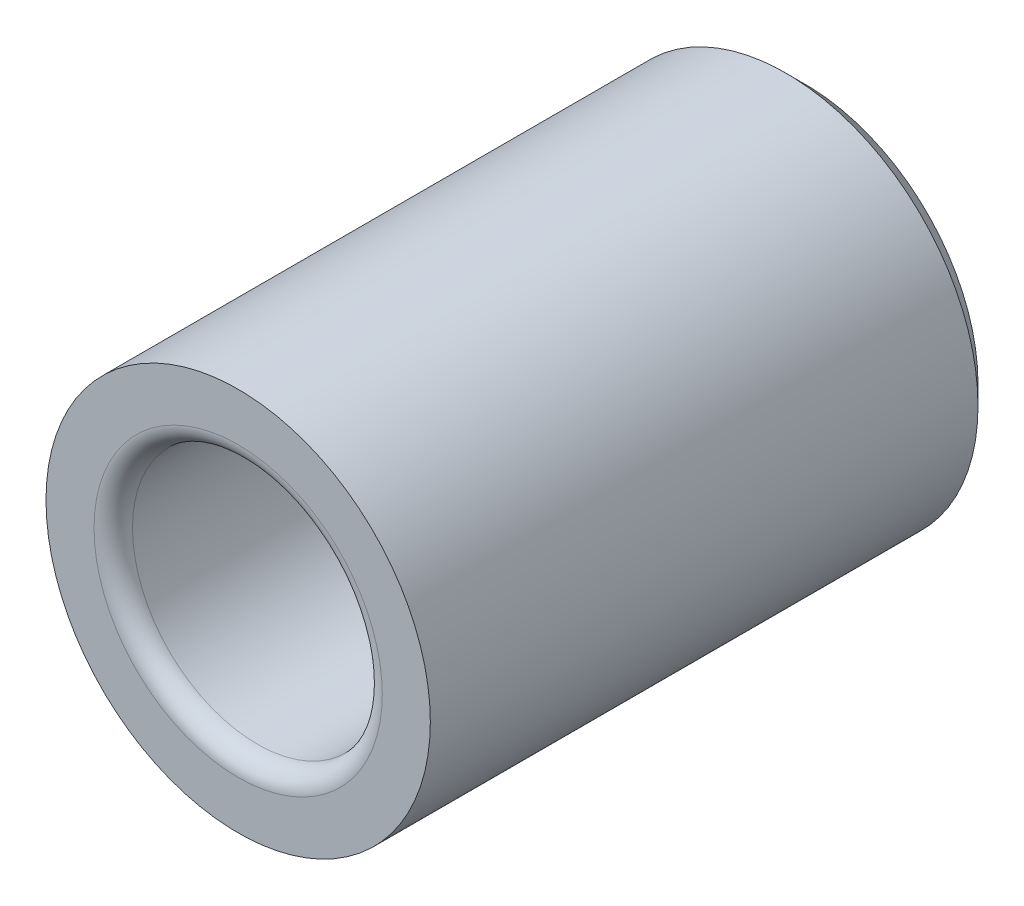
ISO-10303-21;
HEADER;
FILE_DESCRIPTION(('STEP AP214'),'2;1');
FILE_NAME('part.step','',(''),(''),'','','');
FILE_SCHEMA(('AUTOMOTIVE_DESIGN { 1 0 10303 214 1 1 1 1 }'));
ENDSEC;
DATA;
#1=APPLICATION_CONTEXT('core data for automotive mechanical design processes');
#2=APPLICATION_PROTOCOL_DEFINITION('international standard','automotive_design',2000,#1);
#3=PRODUCT_CONTEXT('',#1,'mechanical');
#4=PRODUCT('Part','Part','',(#3));
#5=PRODUCT_RELATED_PRODUCT_CATEGORY('part','',(#4));
#6=PRODUCT_DEFINITION_FORMATION('','',#4);
#7=PRODUCT_DEFINITION_CONTEXT('part definition',#1,'design');
#8=PRODUCT_DEFINITION('design','',#6,#7);
#9=PRODUCT_DEFINITION_SHAPE('','',#8);
#10=(LENGTH_UNIT() NAMED_UNIT(*) SI_UNIT(.MILLI.,.METRE.));
#11=(NAMED_UNIT(*) PLANE_ANGLE_UNIT() SI_UNIT($,.RADIAN.));
#12=(NAMED_UNIT(*) SI_UNIT($,.STERADIAN.) SOLID_ANGLE_UNIT());
#13=UNCERTAINTY_MEASURE_WITH_UNIT(LENGTH_MEASURE(1.E-05),#10,'distance_accuracy_value','');
#14=(GEOMETRIC_REPRESENTATION_CONTEXT(3) GLOBAL_UNCERTAINTY_ASSIGNED_CONTEXT((#13)) GLOBAL_UNIT_ASSIGNED_CONTEXT((#10,
#11,#12)) REPRESENTATION_CONTEXT('',''));
#15=CARTESIAN_POINT('',(0.,0.,0.));
#16=DIRECTION('',(0.,0.,1.));
#17=DIRECTION('',(1.,0.,0.));
#18=AXIS2_PLACEMENT_3D('',#15,#16,#17);
#19=CARTESIAN_POINT('',(0.,0.,-0.5));
#20=DIRECTION('',(0.,0.,-1.));
#21=DIRECTION('',(-1.,0.,0.));
#22=AXIS2_PLACEMENT_3D('',#19,#20,#21);
#23=PLANE('',#22);
#24=CARTESIAN_POINT('',(0.,0.,-0.5));
#25=DIRECTION('',(0.,0.,-1.));
#26=DIRECTION('',(-1.,0.,0.));
#27=AXIS2_PLACEMENT_3D('',#24,#25,#26);
#28=CIRCLE('',#27,7.5);
#29=CARTESIAN_POINT('',(-7.5,0.,-0.499999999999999));
#30=VERTEX_POINT('',#29);
#31=EDGE_CURVE('E50',#30,#30,#28,.T.);
#32=ORIENTED_EDGE('',*,*,#31,.T.);
#33=EDGE_LOOP('',(#32));
#34=FACE_BOUND('',#33,.T.);
#35=CARTESIAN_POINT('',(0.,0.,-0.5));
#36=DIRECTION('',(0.,0.,-1.));
#37=DIRECTION('',(-1.,0.,0.));
#38=AXIS2_PLACEMENT_3D('',#35,#36,#37);
#39=CIRCLE('',#38,10.);
#40=CARTESIAN_POINT('',(-10.,0.,-0.499999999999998));
#41=VERTEX_POINT('',#40);
#42=EDGE_CURVE('E64',#41,#41,#39,.T.);
#43=ORIENTED_EDGE('',*,*,#42,.F.);
#44=EDGE_LOOP('',(#43));
#45=FACE_BOUND('',#44,.T.);
#46=ADVANCED_FACE('F35',(#34,#45),#23,.F.);
#47=CARTESIAN_POINT('',(0.,0.,-0.5));
#48=DIRECTION('',(0.,0.,-1.));
#49=DIRECTION('',(-1.,0.,0.));
#50=AXIS2_PLACEMENT_3D('',#47,#48,#49);
#51=CYLINDRICAL_SURFACE('',#50,10.);
#52=CARTESIAN_POINT('',(0.,0.,-29.));
#53=DIRECTION('',(0.,0.,1.));
#54=DIRECTION('',(1.,0.,0.));
#55=AXIS2_PLACEMENT_3D('',#52,#53,#54);
#56=CIRCLE('',#55,10.);
#57=CARTESIAN_POINT('',(9.99999999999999,0.,-29.));
#58=VERTEX_POINT('',#57);
#59=EDGE_CURVE('E10',#58,#58,#56,.T.);
#60=ORIENTED_EDGE('',*,*,#59,.T.);
#61=EDGE_LOOP('',(#60));
#62=FACE_BOUND('',#61,.T.);
#63=ORIENTED_EDGE('',*,*,#42,.T.);
#64=EDGE_LOOP('',(#63));
#65=FACE_BOUND('',#64,.T.);
#66=ADVANCED_FACE('F82',(#62,#65),#51,.T.);
#67=CARTESIAN_POINT('',(0.,0.,-30.));
#68=DIRECTION('',(0.,0.,1.));
#69=DIRECTION('',(1.,0.,0.));
#70=AXIS2_PLACEMENT_3D('',#67,#68,#69);
#71=PLANE('',#70);
#72=CARTESIAN_POINT('',(0.,0.,-30.));
#73=DIRECTION('',(0.,0.,1.));
#74=DIRECTION('',(1.,0.,0.));
#75=AXIS2_PLACEMENT_3D('',#72,#73,#74);
#76=CIRCLE('',#75,9.);
#77=CARTESIAN_POINT('',(8.99999999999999,0.,-30.));
#78=VERTEX_POINT('',#77);
#79=EDGE_CURVE('E42',#78,#78,#76,.F.);
#80=ORIENTED_EDGE('',*,*,#79,.T.);
#81=EDGE_LOOP('',(#80));
#82=FACE_BOUND('',#81,.T.);
#83=CARTESIAN_POINT('',(0.,0.,-30.));
#84=DIRECTION('',(0.,0.,-1.));
#85=DIRECTION('',(-1.,0.,0.));
#86=AXIS2_PLACEMENT_3D('',#83,#84,#85);
#87=CIRCLE('',#86,2.5);
#88=CARTESIAN_POINT('',(-2.50000000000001,0.,-30.));
#89=VERTEX_POINT('',#88);
#90=EDGE_CURVE('E73',#89,#89,#87,.T.);
#91=ORIENTED_EDGE('',*,*,#90,.F.);
#92=EDGE_LOOP('',(#91));
#93=FACE_BOUND('',#92,.T.);
#94=ADVANCED_FACE('F79',(#82,#93),#71,.F.);
#95=CARTESIAN_POINT('',(0.,0.,-0.5));
#96=DIRECTION('',(0.,0.,-1.));
#97=DIRECTION('',(-1.,0.,0.));
#98=AXIS2_PLACEMENT_3D('',#95,#96,#97);
#99=CYLINDRICAL_SURFACE('',#98,7.75);
#100=CARTESIAN_POINT('',(0.,0.,-15.75));
#101=DIRECTION('',(0.,0.,-1.));
#102=DIRECTION('',(-1.,0.,0.));
#103=AXIS2_PLACEMENT_3D('',#100,#101,#102);
#104=CIRCLE('',#103,7.75);
#105=CARTESIAN_POINT('',(-7.75,0.,-15.75));
#106=VERTEX_POINT('',#105);
#107=EDGE_CURVE('E58',#106,#106,#104,.F.);
#108=ORIENTED_EDGE('',*,*,#107,.T.);
#109=EDGE_LOOP('',(#108));
#110=FACE_BOUND('',#109,.T.);
#111=CARTESIAN_POINT('',(0.,0.,-19.75));
#112=DIRECTION('',(0.,0.,1.));
#113=DIRECTION('',(1.,0.,0.));
#114=AXIS2_PLACEMENT_3D('',#111,#112,#113);
#115=CIRCLE('',#114,7.75);
#116=CARTESIAN_POINT('',(7.74999999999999,0.,-19.75));
#117=VERTEX_POINT('',#116);
#118=EDGE_CURVE('E61',#117,#117,#115,.F.);
#119=ORIENTED_EDGE('',*,*,#118,.T.);
#120=EDGE_LOOP('',(#119));
#121=FACE_BOUND('',#120,.T.);
#122=ADVANCED_FACE('F81',(#110,#121),#99,.F.);
#123=CARTESIAN_POINT('',(0.,0.,-21.));
#124=DIRECTION('',(0.,0.,1.));
#125=DIRECTION('',(1.,0.,0.));
#126=AXIS2_PLACEMENT_3D('',#123,#124,#125);
#127=PLANE('',#126);
#128=CARTESIAN_POINT('',(0.,0.,-21.));
#129=DIRECTION('',(0.,0.,1.));
#130=DIRECTION('',(1.,0.,0.));
#131=AXIS2_PLACEMENT_3D('',#128,#129,#130);
#132=CIRCLE('',#131,2.5);
#133=CARTESIAN_POINT('',(2.49999999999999,0.,-21.));
#134=VERTEX_POINT('',#133);
#135=EDGE_CURVE('E70',#134,#134,#132,.T.);
#136=ORIENTED_EDGE('',*,*,#135,.F.);
#137=EDGE_LOOP('',(#136));
#138=FACE_BOUND('',#137,.T.);
#139=CARTESIAN_POINT('',(0.,0.,-21.));
#140=DIRECTION('',(0.,0.,1.));
#141=DIRECTION('',(1.,0.,0.));
#142=AXIS2_PLACEMENT_3D('',#139,#140,#141);
#143=CIRCLE('',#142,6.5);
#144=CARTESIAN_POINT('',(6.49999999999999,0.,-21.));
#145=VERTEX_POINT('',#144);
#146=EDGE_CURVE('E55',#145,#145,#143,.T.);
#147=ORIENTED_EDGE('',*,*,#146,.T.);
#148=EDGE_LOOP('',(#147));
#149=FACE_BOUND('',#148,.T.);
#150=ADVANCED_FACE('F88',(#138,#149),#127,.T.);
#151=CARTESIAN_POINT('',(0.,0.,-0.5));
#152=DIRECTION('',(0.,0.,-1.));
#153=DIRECTION('',(-1.,0.,0.));
#154=AXIS2_PLACEMENT_3D('',#151,#152,#153);
#155=CYLINDRICAL_SURFACE('',#154,6.5);
#156=CARTESIAN_POINT('',(0.,0.,-1.5));
#157=DIRECTION('',(0.,0.,-1.));
#158=DIRECTION('',(-1.,0.,0.));
#159=AXIS2_PLACEMENT_3D('',#156,#157,#158);
#160=CIRCLE('',#159,6.5);
#161=CARTESIAN_POINT('',(-6.5,0.,-1.5));
#162=VERTEX_POINT('',#161);
#163=EDGE_CURVE('E46',#162,#162,#160,.F.);
#164=ORIENTED_EDGE('',*,*,#163,.T.);
#165=EDGE_LOOP('',(#164));
#166=FACE_BOUND('',#165,.T.);
#167=CARTESIAN_POINT('',(0.,0.,-14.5));
#168=DIRECTION('',(0.,0.,-1.));
#169=DIRECTION('',(-1.,0.,0.));
#170=AXIS2_PLACEMENT_3D('',#167,#168,#169);
#171=CIRCLE('',#170,6.5);
#172=CARTESIAN_POINT('',(-6.5,0.,-14.5));
#173=VERTEX_POINT('',#172);
#174=EDGE_CURVE('E67',#173,#173,#171,.T.);
#175=ORIENTED_EDGE('',*,*,#174,.T.);
#176=EDGE_LOOP('',(#175));
#177=FACE_BOUND('',#176,.T.);
#178=ADVANCED_FACE('F103',(#166,#177),#155,.F.);
#179=CARTESIAN_POINT('',(0.,0.,-15.75));
#180=DIRECTION('',(0.,0.,-1.));
#181=DIRECTION('',(-1.,0.,0.));
#182=AXIS2_PLACEMENT_3D('',#179,#180,#181);
#183=TOROIDAL_SURFACE('',#182,6.5,1.25);
#184=ORIENTED_EDGE('',*,*,#107,.F.);
#185=EDGE_LOOP('',(#184));
#186=FACE_BOUND('',#185,.T.);
#187=ORIENTED_EDGE('',*,*,#174,.F.);
#188=EDGE_LOOP('',(#187));
#189=FACE_BOUND('',#188,.T.);
#190=ADVANCED_FACE('F99',(#186,#189),#183,.F.);
#191=CARTESIAN_POINT('',(0.,0.,-19.75));
#192=DIRECTION('',(0.,0.,1.));
#193=DIRECTION('',(1.,0.,0.));
#194=AXIS2_PLACEMENT_3D('',#191,#192,#193);
#195=TOROIDAL_SURFACE('',#194,6.5,1.25);
#196=ORIENTED_EDGE('',*,*,#146,.F.);
#197=EDGE_LOOP('',(#196));
#198=FACE_BOUND('',#197,.T.);
#199=ORIENTED_EDGE('',*,*,#118,.F.);
#200=EDGE_LOOP('',(#199));
#201=FACE_BOUND('',#200,.T.);
#202=ADVANCED_FACE('F102',(#198,#201),#195,.F.);
#203=CARTESIAN_POINT('',(0.,0.,-30.));
#204=DIRECTION('',(0.,0.,-1.));
#205=DIRECTION('',(-1.,0.,0.));
#206=AXIS2_PLACEMENT_3D('',#203,#204,#205);
#207=CYLINDRICAL_SURFACE('',#206,2.5);
#208=ORIENTED_EDGE('',*,*,#135,.T.);
#209=EDGE_LOOP('',(#208));
#210=FACE_BOUND('',#209,.T.);
#211=ORIENTED_EDGE('',*,*,#90,.T.);
#212=EDGE_LOOP('',(#211));
#213=FACE_BOUND('',#212,.T.);
#214=ADVANCED_FACE('F77',(#210,#213),#207,.F.);
#215=CARTESIAN_POINT('',(0.,0.,-1.5));
#216=DIRECTION('',(0.,0.,-1.));
#217=DIRECTION('',(-1.,0.,0.));
#218=AXIS2_PLACEMENT_3D('',#215,#216,#217);
#219=TOROIDAL_SURFACE('',#218,7.5,1.);
#220=ORIENTED_EDGE('',*,*,#163,.F.);
#221=EDGE_LOOP('',(#220));
#222=FACE_BOUND('',#221,.T.);
#223=ORIENTED_EDGE('',*,*,#31,.F.);
#224=EDGE_LOOP('',(#223));
#225=FACE_BOUND('',#224,.T.);
#226=ADVANCED_FACE('F107',(#222,#225),#219,.T.);
#227=CARTESIAN_POINT('',(0.,0.,-30.));
#228=DIRECTION('',(0.,0.,1.));
#229=DIRECTION('',(1.,0.,0.));
#230=AXIS2_PLACEMENT_3D('',#227,#228,#229);
#231=CONICAL_SURFACE('',#230,9.,0.785398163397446);
#232=ORIENTED_EDGE('',*,*,#59,.F.);
#233=EDGE_LOOP('',(#232));
#234=FACE_BOUND('',#233,.T.);
#235=ORIENTED_EDGE('',*,*,#79,.F.);
#236=EDGE_LOOP('',(#235));
#237=FACE_BOUND('',#236,.T.);
#238=ADVANCED_FACE('F37',(#234,#237),#231,.T.);
#239=CLOSED_SHELL('',(#46,#66,#94,#122,#150,#178,#190,#202,#214,#226,#238));
#240=MANIFOLD_SOLID_BREP('B2',#239);
#241=ADVANCED_BREP_SHAPE_REPRESENTATION('',(#18,#240),#14);
#242=SHAPE_DEFINITION_REPRESENTATION(#9,#241);
ENDSEC;
END-ISO-10303-21;
